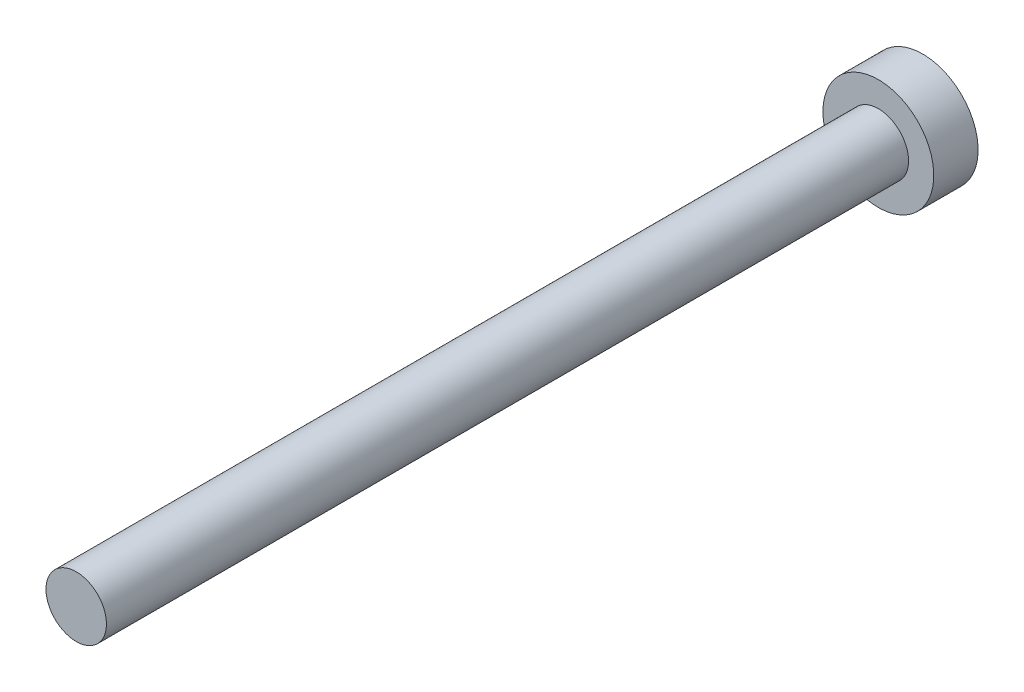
from build123d import *

# Parameters (mm, degrees)
SKETCH1_R           = 1.5
BOSS_EXTRUDE1_DEPTH = 42
SKETCH2_R           = 2.75
BOSS_EXTRUDE2_DEPTH = 2.2
ESCALA1_SCALE       = 1.5


with BuildPart() as part:
    # Sketch1 → Boss-Extrude1 (new body)
    with BuildSketch(Plane.XY):
        with Locations(Location((0, 0, 0), (0, 0, 180))):
            Circle(SKETCH1_R)
    extrude(amount=BOSS_EXTRUDE1_DEPTH)

    # Sketch2 → Boss-Extrude2 (add)
    with BuildSketch(Plane(origin=(0, 0, 0), x_dir=(-1, 0, 0), z_dir=(0, 0, -1))):
        Circle(SKETCH2_R)
    extrude(amount=-BOSS_EXTRUDE2_DEPTH)


with BuildPart() as part_1:
    # Escala1: scaled about (0, 0, 0)
    add(part.part.scale(ESCALA1_SCALE))


solid = part_1.part
